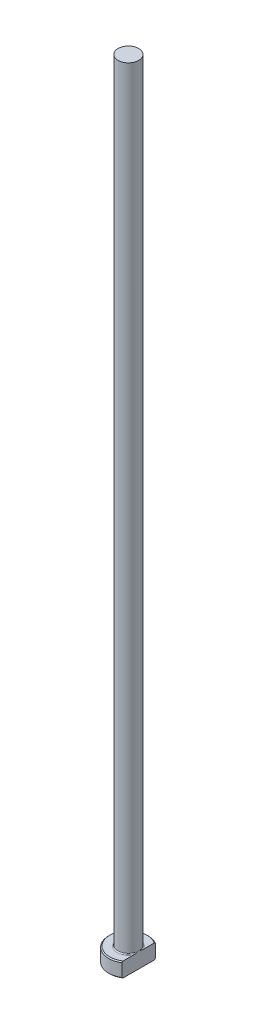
from build123d import *
from build123d.topology import SkipClean

# Parameters (mm, degrees)
CHAMFER1_SIZE = 0.2
FILLET1_R     = 0.2
KEY_DEPTH     = 161.09996877


with BuildPart() as part:
    # Sketch1 → Revolve1 (revolve)
    with BuildSketch(Plane.XY, mode=Mode.PRIVATE) as revolve1_sk:
        Polygon((0, 0), (-4, 0), (-4, 3), (-2.1, 3), (-2.1, 160), (0, 160), align=None)
    revolve(revolve1_sk.sketch.rotate(Axis((0, 259.958771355, 0), (0, -1, 0)), 270), axis=Axis((0, 259.958771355, 0), (0, -1, 0)))

    # Chamfer1
    chamfer1_edges = [part.edges().sort_by_distance(p)[0] for p in [
        (0, 3, -4),
        (0, 0, -4),
    ]]
    chamfer(chamfer1_edges, length=CHAMFER1_SIZE)

    # Fillet1
    fillet1_edges = [part.edges().sort_by_distance(p)[0] for p in [
        (0, 3, -2.1),
    ]]
    fillet(fillet1_edges, radius=FILLET1_R)

    # Sketch2 → KEY (cut, through all)
    with SkipClean():  # the faces are left unmerged after this step: merging them gives an invalid solid
        with BuildSketch(Plane(origin=(0, 0, 0), x_dir=(1, 0, 0), z_dir=(0, 1, 0))):
            with BuildLine():
                Line((2.1, 3.404408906), (2.1, -3.404408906))
                ThreePointArc((2.1, -3.404408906), (4, 0), (2.1, 3.404408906))
            make_face()
        extrude(amount=KEY_DEPTH, mode=Mode.SUBTRACT)


solid = part.part
